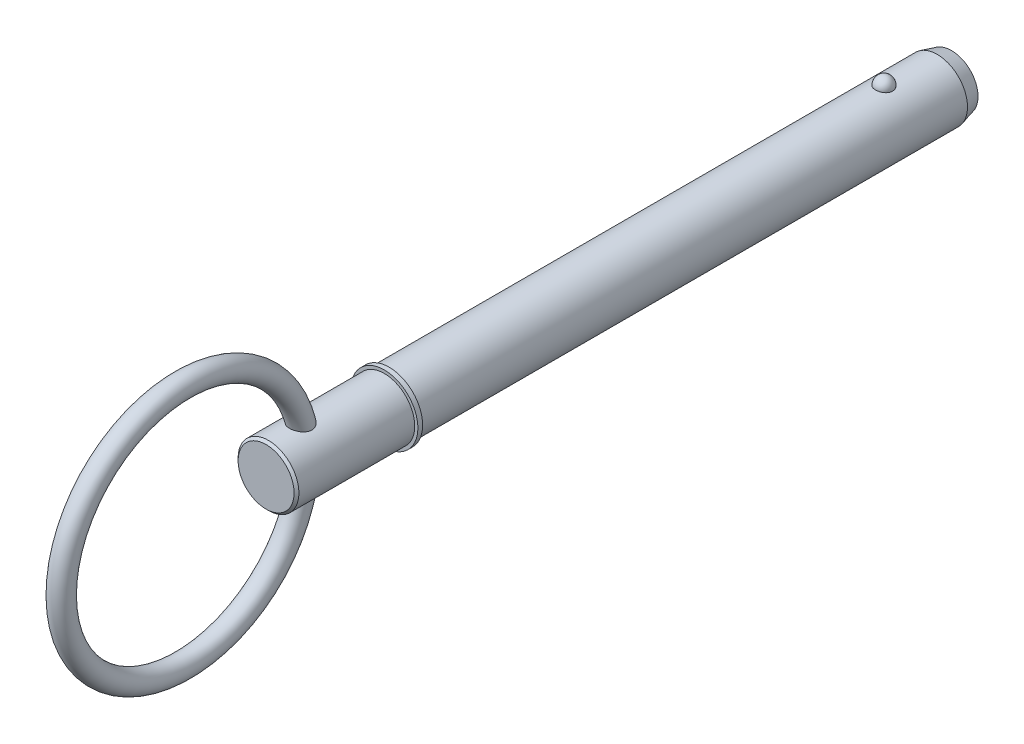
ISO-10303-21;
HEADER;
FILE_DESCRIPTION(('STEP AP214'),'2;1');
FILE_NAME('part.step','',(''),(''),'','','');
FILE_SCHEMA(('AUTOMOTIVE_DESIGN { 1 0 10303 214 1 1 1 1 }'));
ENDSEC;
DATA;
#1=APPLICATION_CONTEXT('core data for automotive mechanical design processes');
#2=APPLICATION_PROTOCOL_DEFINITION('international standard','automotive_design',2000,#1);
#3=PRODUCT_CONTEXT('',#1,'mechanical');
#4=PRODUCT('Part','Part','',(#3));
#5=PRODUCT_RELATED_PRODUCT_CATEGORY('part','',(#4));
#6=PRODUCT_DEFINITION_FORMATION('','',#4);
#7=PRODUCT_DEFINITION_CONTEXT('part definition',#1,'design');
#8=PRODUCT_DEFINITION('design','',#6,#7);
#9=PRODUCT_DEFINITION_SHAPE('','',#8);
#10=(LENGTH_UNIT() NAMED_UNIT(*) SI_UNIT(.MILLI.,.METRE.));
#11=(NAMED_UNIT(*) PLANE_ANGLE_UNIT() SI_UNIT($,.RADIAN.));
#12=(NAMED_UNIT(*) SI_UNIT($,.STERADIAN.) SOLID_ANGLE_UNIT());
#13=UNCERTAINTY_MEASURE_WITH_UNIT(LENGTH_MEASURE(1.E-05),#10,'distance_accuracy_value','');
#14=(GEOMETRIC_REPRESENTATION_CONTEXT(3) GLOBAL_UNCERTAINTY_ASSIGNED_CONTEXT((#13)) GLOBAL_UNIT_ASSIGNED_CONTEXT((#10,
#11,#12)) REPRESENTATION_CONTEXT('',''));
#15=CARTESIAN_POINT('',(0.,0.,0.));
#16=DIRECTION('',(0.,0.,1.));
#17=DIRECTION('',(1.,0.,0.));
#18=AXIS2_PLACEMENT_3D('',#15,#16,#17);
#19=CARTESIAN_POINT('',(0.,0.,101.6));
#20=DIRECTION('',(0.,0.,-1.));
#21=DIRECTION('',(-1.,0.,0.));
#22=AXIS2_PLACEMENT_3D('',#19,#20,#21);
#23=CYLINDRICAL_SURFACE('',#22,6.35);
#24=CARTESIAN_POINT('',(1.76243001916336,6.10051968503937,-1.78));
#25=CARTESIAN_POINT('',(1.76242835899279,6.10052111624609,-1.68050311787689));
#26=CARTESIAN_POINT('',(1.75431593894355,6.1028816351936,-1.58098521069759));
#27=CARTESIAN_POINT('',(1.72206027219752,6.11206037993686,-1.38476972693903));
#28=CARTESIAN_POINT('',(1.69791106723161,6.11888026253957,-1.28807321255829));
#29=CARTESIAN_POINT('',(1.63419596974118,6.13620287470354,-1.10029899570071));
#30=CARTESIAN_POINT('',(1.59463684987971,6.14670398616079,-1.00921884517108));
#31=CARTESIAN_POINT('',(1.50108569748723,6.17021534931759,-0.83516140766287));
#32=CARTESIAN_POINT('',(1.44709398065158,6.18322554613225,-0.752183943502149));
#33=CARTESIAN_POINT('',(1.3257243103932,6.21038081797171,-0.596209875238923));
#34=CARTESIAN_POINT('',(1.2582815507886,6.22453118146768,-0.523264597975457));
#35=CARTESIAN_POINT('',(1.11191624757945,6.25233390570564,-0.389855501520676));
#36=CARTESIAN_POINT('',(1.03299369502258,6.26598626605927,-0.329391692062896));
#37=CARTESIAN_POINT('',(0.866022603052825,6.29123226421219,-0.222793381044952));
#38=CARTESIAN_POINT('',(0.778000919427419,6.30283170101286,-0.176618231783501));
#39=CARTESIAN_POINT('',(0.59510847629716,6.32272058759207,-0.0996905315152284));
#40=CARTESIAN_POINT('',(0.500238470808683,6.33101040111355,-0.0689362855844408));
#41=CARTESIAN_POINT('',(0.308164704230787,6.34323464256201,-0.024159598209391));
#42=CARTESIAN_POINT('',(0.211033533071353,6.34724467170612,-0.00984637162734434));
#43=CARTESIAN_POINT('',(0.0156629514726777,6.3507318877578,0.00262058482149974));
#44=CARTESIAN_POINT('',(-0.0825763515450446,6.35020951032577,0.000775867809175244));
#45=CARTESIAN_POINT('',(-0.275890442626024,6.34473055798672,-0.0188727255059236));
#46=CARTESIAN_POINT('',(-0.370990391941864,6.3398374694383,-0.0364481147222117));
#47=CARTESIAN_POINT('',(-0.556805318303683,6.32622723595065,-0.0867447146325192));
#48=CARTESIAN_POINT('',(-0.647520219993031,6.31751002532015,-0.119466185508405));
#49=CARTESIAN_POINT('',(-0.822606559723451,6.29711353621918,-0.199386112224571));
#50=CARTESIAN_POINT('',(-0.906938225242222,6.28541739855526,-0.246667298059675));
#51=CARTESIAN_POINT('',(-1.06646479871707,6.26032612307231,-0.354365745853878));
#52=CARTESIAN_POINT('',(-1.14165877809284,6.24693081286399,-0.41478434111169));
#53=CARTESIAN_POINT('',(-1.2823514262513,6.21959142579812,-0.548435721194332));
#54=CARTESIAN_POINT('',(-1.34763761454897,6.2056417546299,-0.621891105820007));
#55=CARTESIAN_POINT('',(-1.4651153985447,6.17896241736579,-0.778815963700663));
#56=CARTESIAN_POINT('',(-1.51730606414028,6.16623283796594,-0.862286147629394));
#57=CARTESIAN_POINT('',(-1.60782211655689,6.14325839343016,-1.03799158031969));
#58=CARTESIAN_POINT('',(-1.64598111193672,6.13304379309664,-1.13031660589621));
#59=CARTESIAN_POINT('',(-1.70661885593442,6.11644899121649,-1.32030667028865));
#60=CARTESIAN_POINT('',(-1.72909805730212,6.11006867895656,-1.41797155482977));
#61=CARTESIAN_POINT('',(-1.75775019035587,6.1018881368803,-1.61543246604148));
#62=CARTESIAN_POINT('',(-1.76399136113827,6.10006874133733,-1.71521779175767));
#63=CARTESIAN_POINT('',(-1.76020715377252,6.10116172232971,-1.91445126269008));
#64=CARTESIAN_POINT('',(-1.75018221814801,6.10407397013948,-2.01389941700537));
#65=CARTESIAN_POINT('',(-1.71421005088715,6.11427232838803,-2.20912106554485));
#66=CARTESIAN_POINT('',(-1.68834262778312,6.12153651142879,-2.30491043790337));
#67=CARTESIAN_POINT('',(-1.62139543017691,6.1396067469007,-2.49066180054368));
#68=CARTESIAN_POINT('',(-1.5803150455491,6.15041294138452,-2.58062355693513));
#69=CARTESIAN_POINT('',(-1.48369112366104,6.17443456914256,-2.75271428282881));
#70=CARTESIAN_POINT('',(-1.42806998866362,6.18766281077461,-2.83479789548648));
#71=CARTESIAN_POINT('',(-1.30386620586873,6.21501934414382,-2.98832532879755));
#72=CARTESIAN_POINT('',(-1.23528306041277,6.22914767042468,-3.05976874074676));
#73=CARTESIAN_POINT('',(-1.08663999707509,6.25679135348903,-3.19029656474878));
#74=CARTESIAN_POINT('',(-1.00653826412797,6.27030422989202,-3.24933392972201));
#75=CARTESIAN_POINT('',(-0.837212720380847,6.29514770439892,-3.35304657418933));
#76=CARTESIAN_POINT('',(-0.747989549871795,6.30647845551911,-3.39772286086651));
#77=CARTESIAN_POINT('',(-0.564098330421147,6.32556124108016,-3.47096393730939));
#78=CARTESIAN_POINT('',(-0.469512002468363,6.33335611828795,-3.49972259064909));
#79=CARTESIAN_POINT('',(-0.27663389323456,6.34470628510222,-3.54113722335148));
#80=CARTESIAN_POINT('',(-0.17834256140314,6.34826208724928,-3.55379514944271));
#81=CARTESIAN_POINT('',(0.0171660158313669,6.35071525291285,-3.56255473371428));
#82=CARTESIAN_POINT('',(0.114368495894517,6.34969931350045,-3.55896450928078));
#83=CARTESIAN_POINT('',(0.306746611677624,6.34331695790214,-3.53603383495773));
#84=CARTESIAN_POINT('',(0.401922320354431,6.33795069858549,-3.51669395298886));
#85=CARTESIAN_POINT('',(0.587203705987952,6.32347219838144,-3.4629173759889));
#86=CARTESIAN_POINT('',(0.677327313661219,6.31437430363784,-3.42853846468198));
#87=CARTESIAN_POINT('',(0.850462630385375,6.29339543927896,-3.34564128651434));
#88=CARTESIAN_POINT('',(0.933473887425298,6.2815142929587,-3.29712212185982));
#89=CARTESIAN_POINT('',(1.09144542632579,6.25601750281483,-3.18638742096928));
#90=CARTESIAN_POINT('',(1.16626195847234,6.24237795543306,-3.12397237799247));
#91=CARTESIAN_POINT('',(1.304448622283,6.21497285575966,-2.98755865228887));
#92=CARTESIAN_POINT('',(1.36781676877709,6.20120728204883,-2.91355796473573));
#93=CARTESIAN_POINT('',(1.48252779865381,6.17479923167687,-2.75456133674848));
#94=CARTESIAN_POINT('',(1.53364167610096,6.16218052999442,-2.66939613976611));
#95=CARTESIAN_POINT('',(1.62109397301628,6.13975602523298,-2.49147502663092));
#96=CARTESIAN_POINT('',(1.657437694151,6.12994921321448,-2.39872184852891));
#97=CARTESIAN_POINT('',(1.71127844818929,6.11512175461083,-2.21887622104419));
#98=CARTESIAN_POINT('',(1.73042646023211,6.10968903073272,-2.13230770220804));
#99=CARTESIAN_POINT('',(1.75600284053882,6.10238739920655,-1.95716498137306));
#100=CARTESIAN_POINT('',(1.76243149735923,6.10051841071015,-1.86859082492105));
#101=CARTESIAN_POINT('',(1.76243001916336,6.10051968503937,-1.78));
#102=B_SPLINE_CURVE_WITH_KNOTS('',3,(#24,#25,#26,#27,#28,#29,#30,#31,#32,#33,#34,#35,#36,#37,
#38,#39,#40,#41,#42,#43,#44,#45,#46,#47,#48,#49,#50,#51,#52,#53,#54,#55,#56,#57,#58,#59,#60,#61,
#62,#63,#64,#65,#66,#67,#68,#69,#70,#71,#72,#73,#74,#75,#76,#77,#78,#79,#80,#81,#82,#83,#84,#85,
#86,#87,#88,#89,#90,#91,#92,#93,#94,#95,#96,#97,#98,#99,#100,#101),.UNSPECIFIED.,.T.,.F.,(4,2,2,
2,2,2,2,2,2,2,2,2,2,2,2,2,2,2,2,2,2,2,2,2,2,2,2,2,2,2,2,2,2,2,2,2,2,2,4),(0.,0.298172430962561,
0.596455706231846,0.894608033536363,1.19275383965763,1.49237238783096,1.79199116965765,
2.09074960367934,2.38947519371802,2.68283180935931,2.97616022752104,3.26529599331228,
3.5544367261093,3.84525169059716,4.13609618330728,4.43249276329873,4.72891038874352,
5.02873757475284,5.32855610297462,5.62711261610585,5.92566100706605,6.22271765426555,
6.519786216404,6.81847366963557,7.11717259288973,7.41698459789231,7.71677557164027,
8.01283014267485,8.30884891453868,8.59927798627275,8.88969658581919,9.17900899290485,
9.46833977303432,9.76212836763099,10.0559678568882,10.3549321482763,10.6537890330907,
10.9192841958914,11.1847733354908),.UNSPECIFIED.);
#103=CARTESIAN_POINT('',(1.76243001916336,6.10051968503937,-1.78));
#104=VERTEX_POINT('',#103);
#105=EDGE_CURVE('E100',#104,#104,#102,.T.);
#106=ORIENTED_EDGE('',*,*,#105,.T.);
#107=EDGE_LOOP('',(#106));
#108=FACE_BOUND('',#107,.T.);
#109=CARTESIAN_POINT('',(0.,0.,-12.88));
#110=DIRECTION('',(0.,0.,-1.));
#111=DIRECTION('',(-1.,0.,0.));
#112=AXIS2_PLACEMENT_3D('',#109,#110,#111);
#113=CIRCLE('',#112,6.35);
#114=CARTESIAN_POINT('',(-6.35,0.,-12.88));
#115=VERTEX_POINT('',#114);
#116=EDGE_CURVE('E108',#115,#115,#113,.F.);
#117=ORIENTED_EDGE('',*,*,#116,.T.);
#118=EDGE_LOOP('',(#117));
#119=FACE_BOUND('',#118,.T.);
#120=CARTESIAN_POINT('',(0.,0.,101.6));
#121=DIRECTION('',(0.,0.,1.));
#122=DIRECTION('',(1.,0.,0.));
#123=AXIS2_PLACEMENT_3D('',#120,#121,#122);
#124=CIRCLE('',#123,6.35);
#125=CARTESIAN_POINT('',(6.35,0.,101.6));
#126=VERTEX_POINT('',#125);
#127=EDGE_CURVE('E106',#126,#126,#124,.T.);
#128=ORIENTED_EDGE('',*,*,#127,.F.);
#129=EDGE_LOOP('',(#128));
#130=FACE_BOUND('',#129,.T.);
#131=ADVANCED_FACE('F39',(#108,#119,#130),#23,.T.);
#132=CARTESIAN_POINT('',(0.,0.,-15.88));
#133=DIRECTION('',(0.,0.,-1.));
#134=DIRECTION('',(-1.,0.,0.));
#135=AXIS2_PLACEMENT_3D('',#132,#133,#134);
#136=PLANE('',#135);
#137=CARTESIAN_POINT('',(0.,0.,-15.88));
#138=DIRECTION('',(0.,0.,-1.));
#139=DIRECTION('',(-1.,0.,0.));
#140=AXIS2_PLACEMENT_3D('',#137,#138,#139);
#141=CIRCLE('',#140,5.54615242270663);
#142=CARTESIAN_POINT('',(-5.54615242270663,0.,-15.88));
#143=VERTEX_POINT('',#142);
#144=EDGE_CURVE('E141',#143,#143,#141,.T.);
#145=ORIENTED_EDGE('',*,*,#144,.T.);
#146=EDGE_LOOP('',(#145));
#147=FACE_BOUND('',#146,.T.);
#148=ADVANCED_FACE('F86',(#147),#136,.T.);
#149=CARTESIAN_POINT('',(0.,0.,-15.88));
#150=DIRECTION('',(0.,0.,1.));
#151=DIRECTION('',(1.,0.,0.));
#152=AXIS2_PLACEMENT_3D('',#149,#150,#151);
#153=CONICAL_SURFACE('',#152,5.54615242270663,0.261799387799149);
#154=ORIENTED_EDGE('',*,*,#116,.F.);
#155=EDGE_LOOP('',(#154));
#156=FACE_BOUND('',#155,.T.);
#157=ORIENTED_EDGE('',*,*,#144,.F.);
#158=EDGE_LOOP('',(#157));
#159=FACE_BOUND('',#158,.T.);
#160=ADVANCED_FACE('F92',(#156,#159),#153,.T.);
#161=CARTESIAN_POINT('',(0.,6.35,-1.78));
#162=DIRECTION('',(0.,1.,0.));
#163=DIRECTION('',(0.,0.,1.));
#164=AXIS2_PLACEMENT_3D('',#161,#162,#163);
#165=SPHERICAL_SURFACE('',#164,1.78);
#166=ORIENTED_EDGE('',*,*,#105,.F.);
#167=EDGE_LOOP('',(#166));
#168=FACE_BOUND('',#167,.T.);
#169=ADVANCED_FACE('F111',(#168),#165,.T.);
#170=CARTESIAN_POINT('',(0.,0.,101.6));
#171=DIRECTION('',(0.,0.,-1.));
#172=DIRECTION('',(-1.,0.,0.));
#173=AXIS2_PLACEMENT_3D('',#170,#171,#172);
#174=PLANE('',#173);
#175=ORIENTED_EDGE('',*,*,#127,.T.);
#176=EDGE_LOOP('',(#175));
#177=FACE_BOUND('',#176,.T.);
#178=CARTESIAN_POINT('',(0.,0.,101.6));
#179=DIRECTION('',(0.,0.,-1.));
#180=DIRECTION('',(-1.,0.,0.));
#181=AXIS2_PLACEMENT_3D('',#178,#179,#180);
#182=CIRCLE('',#181,7.);
#183=CARTESIAN_POINT('',(-7.,0.,101.6));
#184=VERTEX_POINT('',#183);
#185=EDGE_CURVE('E107',#184,#184,#182,.T.);
#186=ORIENTED_EDGE('',*,*,#185,.T.);
#187=EDGE_LOOP('',(#186));
#188=FACE_BOUND('',#187,.T.);
#189=ADVANCED_FACE('F115',(#177,#188),#174,.T.);
#190=CARTESIAN_POINT('',(0.,0.,33.7287874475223));
#191=DIRECTION('',(0.,0.,-1.));
#192=DIRECTION('',(-1.,0.,0.));
#193=AXIS2_PLACEMENT_3D('',#190,#191,#192);
#194=CYLINDRICAL_SURFACE('',#193,7.);
#195=CARTESIAN_POINT('',(0.,0.,102.6));
#196=DIRECTION('',(0.,0.,-1.));
#197=DIRECTION('',(-1.,0.,0.));
#198=AXIS2_PLACEMENT_3D('',#195,#196,#197);
#199=CIRCLE('',#198,7.);
#200=CARTESIAN_POINT('',(-7.,0.,102.6));
#201=VERTEX_POINT('',#200);
#202=EDGE_CURVE('E132',#201,#201,#199,.T.);
#203=ORIENTED_EDGE('',*,*,#202,.T.);
#204=EDGE_LOOP('',(#203));
#205=FACE_BOUND('',#204,.T.);
#206=ORIENTED_EDGE('',*,*,#185,.F.);
#207=EDGE_LOOP('',(#206));
#208=FACE_BOUND('',#207,.T.);
#209=ADVANCED_FACE('F119',(#205,#208),#194,.T.);
#210=CARTESIAN_POINT('',(0.,7.,102.6));
#211=DIRECTION('',(0.,0.,1.));
#212=DIRECTION('',(1.,0.,0.));
#213=AXIS2_PLACEMENT_3D('',#210,#211,#212);
#214=PLANE('',#213);
#215=CARTESIAN_POINT('',(0.,0.,102.6));
#216=DIRECTION('',(0.,0.,1.));
#217=DIRECTION('',(1.,0.,0.));
#218=AXIS2_PLACEMENT_3D('',#215,#216,#217);
#219=CIRCLE('',#218,6.35);
#220=CARTESIAN_POINT('',(6.35,0.,102.6));
#221=VERTEX_POINT('',#220);
#222=EDGE_CURVE('E110',#221,#221,#219,.T.);
#223=ORIENTED_EDGE('',*,*,#222,.F.);
#224=EDGE_LOOP('',(#223));
#225=FACE_BOUND('',#224,.T.);
#226=ORIENTED_EDGE('',*,*,#202,.F.);
#227=EDGE_LOOP('',(#226));
#228=FACE_BOUND('',#227,.T.);
#229=ADVANCED_FACE('F83',(#225,#228),#214,.T.);
#230=CARTESIAN_POINT('',(0.,0.,127.3));
#231=DIRECTION('',(0.,0.,-1.));
#232=DIRECTION('',(-1.,0.,0.));
#233=AXIS2_PLACEMENT_3D('',#230,#231,#232);
#234=CYLINDRICAL_SURFACE('',#233,6.35);
#235=CARTESIAN_POINT('',(-1.08120660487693,-6.25727514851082,118.05158117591));
#236=CARTESIAN_POINT('',(-0.970724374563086,-6.27636409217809,117.993879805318));
#237=CARTESIAN_POINT('',(-0.855136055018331,-6.29329984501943,117.945219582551));
#238=CARTESIAN_POINT('',(-0.616958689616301,-6.32109419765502,117.86705594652));
#239=CARTESIAN_POINT('',(-0.494369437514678,-6.3319526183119,117.83755309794));
#240=CARTESIAN_POINT('',(-0.245606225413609,-6.34647141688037,117.798367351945));
#241=CARTESIAN_POINT('',(-0.119431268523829,-6.35012977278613,117.788690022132));
#242=CARTESIAN_POINT('',(0.132849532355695,-6.34986313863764,117.789400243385));
#243=CARTESIAN_POINT('',(0.258955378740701,-6.34593843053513,117.799787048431));
#244=CARTESIAN_POINT('',(0.50691297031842,-6.33094785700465,117.840285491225));
#245=CARTESIAN_POINT('',(0.628781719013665,-6.31991516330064,117.870305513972));
#246=CARTESIAN_POINT('',(0.865486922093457,-6.29187143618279,117.949308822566));
#247=CARTESIAN_POINT('',(0.980322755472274,-6.27485987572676,117.998293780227));
#248=CARTESIAN_POINT('',(1.20050616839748,-6.23649440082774,118.114540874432));
#249=CARTESIAN_POINT('',(1.30578867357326,-6.21511352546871,118.181917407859));
#250=CARTESIAN_POINT('',(1.50311440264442,-6.17036440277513,118.333359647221));
#251=CARTESIAN_POINT('',(1.59515714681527,-6.14699608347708,118.417425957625));
#252=CARTESIAN_POINT('',(1.76326863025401,-6.10090072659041,118.600247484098));
#253=CARTESIAN_POINT('',(1.83935482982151,-6.07817301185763,118.698986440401));
#254=CARTESIAN_POINT('',(1.97338559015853,-6.03599268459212,118.908703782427));
#255=CARTESIAN_POINT('',(2.03133638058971,-6.01653894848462,119.019677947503));
#256=CARTESIAN_POINT('',(2.1259120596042,-5.98376466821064,119.247018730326));
#257=CARTESIAN_POINT('',(2.16315310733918,-5.97026970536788,119.363104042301));
#258=CARTESIAN_POINT('',(2.21830650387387,-5.94999923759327,119.600318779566));
#259=CARTESIAN_POINT('',(2.2362211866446,-5.94322292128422,119.721447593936));
#260=CARTESIAN_POINT('',(2.25273772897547,-5.93698111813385,119.963281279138));
#261=CARTESIAN_POINT('',(2.25163224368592,-5.93740484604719,120.083964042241));
#262=CARTESIAN_POINT('',(2.23167546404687,-5.94493297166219,120.323620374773));
#263=CARTESIAN_POINT('',(2.21281883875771,-5.9520393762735,120.442593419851));
#264=CARTESIAN_POINT('',(2.15679576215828,-5.97257680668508,120.683836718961));
#265=CARTESIAN_POINT('',(2.11851138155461,-5.98639144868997,120.80581287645));
#266=CARTESIAN_POINT('',(2.02470263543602,-6.01876484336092,121.042284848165));
#267=CARTESIAN_POINT('',(1.96916879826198,-6.03732620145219,121.156776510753));
#268=CARTESIAN_POINT('',(1.8352662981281,-6.07945247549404,121.387995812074));
#269=CARTESIAN_POINT('',(1.75507038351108,-6.10334207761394,121.503611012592));
#270=CARTESIAN_POINT('',(1.57657889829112,-6.15186551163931,121.719894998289));
#271=CARTESIAN_POINT('',(1.47827192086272,-6.17649980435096,121.820554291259));
#272=CARTESIAN_POINT('',(1.26306696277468,-6.22410762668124,122.005023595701));
#273=CARTESIAN_POINT('',(1.14585214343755,-6.24704086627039,122.088478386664));
#274=CARTESIAN_POINT('',(0.896825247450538,-6.28760987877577,122.231400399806));
#275=CARTESIAN_POINT('',(0.765036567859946,-6.30525397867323,122.290905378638));
#276=CARTESIAN_POINT('',(0.509454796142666,-6.330648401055,122.375263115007));
#277=CARTESIAN_POINT('',(0.386964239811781,-6.33940909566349,122.403695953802));
#278=CARTESIAN_POINT('',(0.200813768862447,-6.3471308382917,122.428680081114));
#279=CARTESIAN_POINT('',(0.138353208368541,-6.34880140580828,122.434063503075));
#280=CARTESIAN_POINT('',(0.013184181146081,-6.35029448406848,122.43887386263));
#281=CARTESIAN_POINT('',(-0.04952425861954,-6.35011719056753,122.438301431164));
#282=CARTESIAN_POINT('',(-0.219860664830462,-6.34710452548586,122.428597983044));
#283=CARTESIAN_POINT('',(-0.327176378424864,-6.34243953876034,122.413576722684));
#284=CARTESIAN_POINT('',(-0.537619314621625,-6.32808248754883,122.366673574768));
#285=CARTESIAN_POINT('',(-0.640746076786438,-6.31838987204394,122.334789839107));
#286=CARTESIAN_POINT('',(-0.841795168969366,-6.29478075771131,122.255337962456));
#287=CARTESIAN_POINT('',(-0.939631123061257,-6.28081033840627,122.20756888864));
#288=CARTESIAN_POINT('',(-1.12690564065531,-6.2499288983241,122.098513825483));
#289=CARTESIAN_POINT('',(-1.21634109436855,-6.2330167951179,122.037222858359));
#290=CARTESIAN_POINT('',(-1.3971303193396,-6.19517308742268,121.894039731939));
#291=CARTESIAN_POINT('',(-1.48711596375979,-6.17400700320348,121.810483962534));
#292=CARTESIAN_POINT('',(-1.65373642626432,-6.13148145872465,121.630996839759));
#293=CARTESIAN_POINT('',(-1.73036130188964,-6.11012186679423,121.53505636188));
#294=CARTESIAN_POINT('',(-1.87908981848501,-6.06616529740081,121.318620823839));
#295=CARTESIAN_POINT('',(-1.94902044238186,-6.04382072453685,121.196572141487));
#296=CARTESIAN_POINT('',(-2.06849605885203,-6.00398244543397,120.942070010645));
#297=CARTESIAN_POINT('',(-2.11803457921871,-5.98649027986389,120.809613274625));
#298=CARTESIAN_POINT('',(-2.19551930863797,-5.95851933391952,120.534593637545));
#299=CARTESIAN_POINT('',(-2.22297667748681,-5.94819998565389,120.391874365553));
#300=CARTESIAN_POINT('',(-2.25222139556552,-5.93719450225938,120.103480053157));
#301=CARTESIAN_POINT('',(-2.25403508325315,-5.93649848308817,119.957808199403));
#302=CARTESIAN_POINT('',(-2.23178480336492,-5.94489150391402,119.683804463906));
#303=CARTESIAN_POINT('',(-2.21035650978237,-5.95298402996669,119.555226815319));
#304=CARTESIAN_POINT('',(-2.14565882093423,-5.97660650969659,119.30440891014));
#305=CARTESIAN_POINT('',(-2.10239634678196,-5.99213410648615,119.182166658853));
#306=CARTESIAN_POINT('',(-1.99913159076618,-6.02732890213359,118.956747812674));
#307=CARTESIAN_POINT('',(-1.94060271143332,-6.04660536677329,118.852829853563));
#308=CARTESIAN_POINT('',(-1.80736340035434,-6.0877569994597,118.656534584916));
#309=CARTESIAN_POINT('',(-1.73265259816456,-6.10963222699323,118.564157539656));
#310=CARTESIAN_POINT('',(-1.56865095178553,-6.15378470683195,118.392603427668));
#311=CARTESIAN_POINT('',(-1.47928749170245,-6.17606344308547,118.313496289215));
#312=CARTESIAN_POINT('',(-1.28858731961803,-6.21864788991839,118.170675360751));
#313=CARTESIAN_POINT('',(-1.18724893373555,-6.23895332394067,118.106963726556));
#314=CARTESIAN_POINT('',(-1.08120660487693,-6.25727514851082,118.05158117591));
#315=B_SPLINE_CURVE_WITH_KNOTS('',3,(#235,#236,#237,#238,#239,#240,#241,#242,#243,#244,#245,
#246,#247,#248,#249,#250,#251,#252,#253,#254,#255,#256,#257,#258,#259,#260,#261,#262,#263,#264,
#265,#266,#267,#268,#269,#270,#271,#272,#273,#274,#275,#276,#277,#278,#279,#280,#281,#282,#283,
#284,#285,#286,#287,#288,#289,#290,#291,#292,#293,#294,#295,#296,#297,#298,#299,#300,#301,#302,
#303,#304,#305,#306,#307,#308,#309,#310,#311,#312,#313,#314),.UNSPECIFIED.,.T.,.F.,(4,2,2,2,2,2,
2,2,2,2,2,2,2,2,2,2,2,2,2,2,2,2,2,2,2,2,2,2,2,2,2,2,2,2,2,2,2,2,2,4),(0.,0.377861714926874,
0.755734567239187,1.13371352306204,1.51167842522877,1.88789208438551,2.26413891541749,
2.64278156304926,3.02143792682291,3.39967776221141,3.77778752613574,4.14394628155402,
4.51006081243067,4.87054720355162,5.23114188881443,5.61534494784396,5.99975934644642,
6.42600522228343,6.85252048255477,7.28711365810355,7.72101899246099,8.0966613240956,
8.28452949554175,8.47237776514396,8.79607953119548,9.11981678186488,9.44781545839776,
9.77593508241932,10.1483085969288,10.5209580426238,10.9463240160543,11.3718248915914,
11.8065046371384,12.2407378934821,12.6304236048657,13.0199858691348,13.3807583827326,
13.7415391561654,14.104165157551,14.4668419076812),.UNSPECIFIED.);
#316=CARTESIAN_POINT('',(-1.08120660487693,-6.25727514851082,118.05158117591));
#317=VERTEX_POINT('',#316);
#318=EDGE_CURVE('E10',#317,#317,#315,.T.);
#319=ORIENTED_EDGE('',*,*,#318,.F.);
#320=EDGE_LOOP('',(#319));
#321=FACE_BOUND('',#320,.T.);
#322=CARTESIAN_POINT('',(-1.08120660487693,6.25727514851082,118.05158117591));
#323=CARTESIAN_POINT('',(-1.19093168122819,6.23831652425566,118.108887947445));
#324=CARTESIAN_POINT('',(-1.29562751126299,6.21723224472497,118.175116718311));
#325=CARTESIAN_POINT('',(-1.49211272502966,6.17302620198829,118.324020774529));
#326=CARTESIAN_POINT('',(-1.58390200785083,6.14990442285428,118.406696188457));
#327=CARTESIAN_POINT('',(-1.75209695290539,6.10411985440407,118.586777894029));
#328=CARTESIAN_POINT('',(-1.82848346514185,6.08145766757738,118.684202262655));
#329=CARTESIAN_POINT('',(-1.96346259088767,6.0392331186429,118.891273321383));
#330=CARTESIAN_POINT('',(-2.02206050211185,6.01966983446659,119.000916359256));
#331=CARTESIAN_POINT('',(-2.11860444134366,5.9863659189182,119.226564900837));
#332=CARTESIAN_POINT('',(-2.15701637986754,5.97249571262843,119.342351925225));
#333=CARTESIAN_POINT('',(-2.21449304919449,5.95142584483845,119.579191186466));
#334=CARTESIAN_POINT('',(-2.23356015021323,5.94422536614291,119.700242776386));
#335=CARTESIAN_POINT('',(-2.25228141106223,5.93715610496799,119.941944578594));
#336=CARTESIAN_POINT('',(-2.25225786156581,5.93716560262,120.062567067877));
#337=CARTESIAN_POINT('',(-2.2344206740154,5.94389982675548,120.302277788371));
#338=CARTESIAN_POINT('',(-2.21660184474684,5.95062651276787,120.421365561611));
#339=CARTESIAN_POINT('',(-2.16272689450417,5.97042554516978,120.662705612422));
#340=CARTESIAN_POINT('',(-2.12559286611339,5.98387086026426,120.784684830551));
#341=CARTESIAN_POINT('',(-2.03409944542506,6.0155857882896,121.021342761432));
#342=CARTESIAN_POINT('',(-1.97973080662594,6.03385799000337,121.136017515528));
#343=CARTESIAN_POINT('',(-1.84828023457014,6.07549301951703,121.367865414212));
#344=CARTESIAN_POINT('',(-1.76936622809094,6.09919386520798,121.483943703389));
#345=CARTESIAN_POINT('',(-1.59344783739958,6.14749881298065,121.701420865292));
#346=CARTESIAN_POINT('',(-1.49643151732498,6.17210350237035,121.802809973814));
#347=CARTESIAN_POINT('',(-1.28333318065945,6.21994692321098,121.989508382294));
#348=CARTESIAN_POINT('',(-1.16685721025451,6.24314005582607,122.0743845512));
#349=CARTESIAN_POINT('',(-0.919062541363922,6.2843871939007,122.22034404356));
#350=CARTESIAN_POINT('',(-0.787766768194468,6.30244898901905,122.281463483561));
#351=CARTESIAN_POINT('',(-0.532335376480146,6.32876911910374,122.36911129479));
#352=CARTESIAN_POINT('',(-0.409516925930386,6.33800211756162,122.399123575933));
#353=CARTESIAN_POINT('',(-0.222636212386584,6.34640533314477,122.426338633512));
#354=CARTESIAN_POINT('',(-0.159893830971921,6.34829860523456,122.432442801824));
#355=CARTESIAN_POINT('',(-0.0340877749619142,6.35021985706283,122.43863417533));
#356=CARTESIAN_POINT('',(0.0289758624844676,6.35024804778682,122.43872206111));
#357=CARTESIAN_POINT('',(0.200008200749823,6.34776620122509,122.430732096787));
#358=CARTESIAN_POINT('',(0.307730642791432,6.34342046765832,122.41675007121));
#359=CARTESIAN_POINT('',(0.51913450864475,6.32963338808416,122.371765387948));
#360=CARTESIAN_POINT('',(0.622815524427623,6.3201915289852,122.340761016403));
#361=CARTESIAN_POINT('',(0.824580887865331,6.2970603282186,122.263086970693));
#362=CARTESIAN_POINT('',(0.922611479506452,6.28333629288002,122.216289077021));
#363=CARTESIAN_POINT('',(1.11039970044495,6.2528858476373,122.109122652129));
#364=CARTESIAN_POINT('',(1.20015435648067,6.23615836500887,122.048749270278));
#365=CARTESIAN_POINT('',(1.38155818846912,6.19866747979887,121.90760245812));
#366=CARTESIAN_POINT('',(1.47187645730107,6.17766310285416,121.825184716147));
#367=CARTESIAN_POINT('',(1.6393362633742,6.135352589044,121.647946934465));
#368=CARTESIAN_POINT('',(1.71646809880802,6.11404624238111,121.553117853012));
#369=CARTESIAN_POINT('',(1.86660460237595,6.07002946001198,121.338851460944));
#370=CARTESIAN_POINT('',(1.93743710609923,6.04755477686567,121.217834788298));
#371=CARTESIAN_POINT('',(2.0589430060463,6.00727604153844,120.965280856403));
#372=CARTESIAN_POINT('',(2.1096091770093,5.98947366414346,120.833739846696));
#373=CARTESIAN_POINT('',(2.18982014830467,5.96062717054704,120.559758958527));
#374=CARTESIAN_POINT('',(2.21877575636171,5.94977267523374,120.417123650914));
#375=CARTESIAN_POINT('',(2.2510475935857,5.93764416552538,120.128595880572));
#376=CARTESIAN_POINT('',(2.25438985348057,5.93636042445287,119.982706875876));
#377=CARTESIAN_POINT('',(2.23498011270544,5.9436885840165,119.707731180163));
#378=CARTESIAN_POINT('',(2.21482640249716,5.95131530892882,119.578434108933));
#379=CARTESIAN_POINT('',(2.15248760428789,5.97414352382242,119.325969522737));
#380=CARTESIAN_POINT('',(2.11031020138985,5.98934237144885,119.202799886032));
#381=CARTESIAN_POINT('',(2.00904610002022,6.02402214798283,118.975783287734));
#382=CARTESIAN_POINT('',(1.95150192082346,6.04308594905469,118.871178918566));
#383=CARTESIAN_POINT('',(1.82009972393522,6.08395083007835,118.673382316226));
#384=CARTESIAN_POINT('',(1.74624088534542,6.10575204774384,118.580190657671));
#385=CARTESIAN_POINT('',(1.58309476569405,6.15008431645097,118.406164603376));
#386=CARTESIAN_POINT('',(1.49360904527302,6.17262128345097,118.325518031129));
#387=CARTESIAN_POINT('',(1.30231515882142,6.21579297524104,118.179836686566));
#388=CARTESIAN_POINT('',(1.20050521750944,6.23642742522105,118.11480416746));
#389=CARTESIAN_POINT('',(0.98378657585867,6.27432316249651,117.9998596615));
#390=CARTESIAN_POINT('',(0.868563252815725,6.29145558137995,117.950497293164));
#391=CARTESIAN_POINT('',(0.630994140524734,6.31970327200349,117.870885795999));
#392=CARTESIAN_POINT('',(0.508648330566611,6.33081852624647,117.840636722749));
#393=CARTESIAN_POINT('',(0.259933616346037,6.34590352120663,117.799879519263));
#394=CARTESIAN_POINT('',(0.133554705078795,6.34985380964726,117.789425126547));
#395=CARTESIAN_POINT('',(-0.119270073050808,6.35013815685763,117.788667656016));
#396=CARTESIAN_POINT('',(-0.245715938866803,6.34647233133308,117.798364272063));
#397=CARTESIAN_POINT('',(-0.494670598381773,6.33192772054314,117.837620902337));
#398=CARTESIAN_POINT('',(-0.617189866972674,6.3210701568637,117.867122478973));
#399=CARTESIAN_POINT('',(-0.855240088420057,6.29328476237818,117.945263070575));
#400=CARTESIAN_POINT('',(-0.970770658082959,6.27635659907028,117.993903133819));
#401=CARTESIAN_POINT('',(-1.08120660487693,6.25727514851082,118.05158117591));
#402=B_SPLINE_CURVE_WITH_KNOTS('',3,(#322,#323,#324,#325,#326,#327,#328,#329,#330,#331,#332,
#333,#334,#335,#336,#337,#338,#339,#340,#341,#342,#343,#344,#345,#346,#347,#348,#349,#350,#351,
#352,#353,#354,#355,#356,#357,#358,#359,#360,#361,#362,#363,#364,#365,#366,#367,#368,#369,#370,
#371,#372,#373,#374,#375,#376,#377,#378,#379,#380,#381,#382,#383,#384,#385,#386,#387,#388,#389,
#390,#391,#392,#393,#394,#395,#396,#397,#398,#399,#400,#401),.UNSPECIFIED.,.T.,.F.,(4,2,2,2,2,2,
2,2,2,2,2,2,2,2,2,2,2,2,2,2,2,2,2,2,2,2,2,2,2,2,2,2,2,2,2,2,2,2,2,4),(0.,0.375258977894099,
0.750520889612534,1.1262465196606,1.50186014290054,1.86837438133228,2.2348437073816,
2.59512638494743,2.95551419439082,3.33859924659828,3.7218901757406,4.14704029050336,
4.57247172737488,5.00788576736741,5.4426352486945,5.82040093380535,6.00932292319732,
6.19822354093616,6.52266071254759,6.84713055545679,7.17430063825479,7.50158780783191,
7.87233275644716,8.24334931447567,8.66748794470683,9.09177840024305,9.52720369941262,
9.96218641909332,10.3532895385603,10.7442562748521,11.1052784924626,11.4663188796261,
11.8323306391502,12.1983951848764,12.5761580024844,12.9539219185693,13.3327099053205,
13.7114921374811,14.0891615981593,14.4668517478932),.UNSPECIFIED.);
#403=CARTESIAN_POINT('',(-1.08120660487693,6.25727514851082,118.05158117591));
#404=VERTEX_POINT('',#403);
#405=EDGE_CURVE('E51',#404,#404,#402,.T.);
#406=ORIENTED_EDGE('',*,*,#405,.F.);
#407=EDGE_LOOP('',(#406));
#408=FACE_BOUND('',#407,.T.);
#409=CARTESIAN_POINT('',(0.,0.,126.8));
#410=DIRECTION('',(0.,0.,-1.));
#411=DIRECTION('',(-1.,0.,0.));
#412=AXIS2_PLACEMENT_3D('',#409,#410,#411);
#413=CIRCLE('',#412,6.35);
#414=CARTESIAN_POINT('',(-6.35,0.,126.8));
#415=VERTEX_POINT('',#414);
#416=EDGE_CURVE('E62',#415,#415,#413,.T.);
#417=ORIENTED_EDGE('',*,*,#416,.T.);
#418=EDGE_LOOP('',(#417));
#419=FACE_BOUND('',#418,.T.);
#420=ORIENTED_EDGE('',*,*,#222,.T.);
#421=EDGE_LOOP('',(#420));
#422=FACE_BOUND('',#421,.T.);
#423=ADVANCED_FACE('F67',(#321,#408,#419,#422),#234,.T.);
#424=CARTESIAN_POINT('',(0.,0.,127.3));
#425=DIRECTION('',(0.,0.,-1.));
#426=DIRECTION('',(-1.,0.,0.));
#427=AXIS2_PLACEMENT_3D('',#424,#425,#426);
#428=PLANE('',#427);
#429=CARTESIAN_POINT('',(0.,0.,127.3));
#430=DIRECTION('',(0.,0.,-1.));
#431=DIRECTION('',(-1.,0.,0.));
#432=AXIS2_PLACEMENT_3D('',#429,#430,#431);
#433=CIRCLE('',#432,5.84999999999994);
#434=CARTESIAN_POINT('',(-5.84999999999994,0.,127.3));
#435=VERTEX_POINT('',#434);
#436=EDGE_CURVE('E57',#435,#435,#433,.F.);
#437=ORIENTED_EDGE('',*,*,#436,.T.);
#438=EDGE_LOOP('',(#437));
#439=FACE_BOUND('',#438,.T.);
#440=ADVANCED_FACE('F74',(#439),#428,.F.);
#441=CARTESIAN_POINT('',(0.,0.,126.8));
#442=DIRECTION('',(0.,0.,-1.));
#443=DIRECTION('',(-1.,0.,0.));
#444=AXIS2_PLACEMENT_3D('',#441,#442,#443);
#445=CONICAL_SURFACE('',#444,6.35,0.785398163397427);
#446=ORIENTED_EDGE('',*,*,#436,.F.);
#447=EDGE_LOOP('',(#446));
#448=FACE_BOUND('',#447,.T.);
#449=ORIENTED_EDGE('',*,*,#416,.F.);
#450=EDGE_LOOP('',(#449));
#451=FACE_BOUND('',#450,.T.);
#452=ADVANCED_FACE('F41',(#448,#451),#445,.T.);
#453=CARTESIAN_POINT('',(0.,0.,144.7));
#454=DIRECTION('',(1.,0.,0.));
#455=DIRECTION('',(0.,0.,-1.));
#456=AXIS2_PLACEMENT_3D('',#453,#454,#455);
#457=TOROIDAL_SURFACE('',#456,25.4,2.25);
#458=ORIENTED_EDGE('',*,*,#318,.T.);
#459=EDGE_LOOP('',(#458));
#460=FACE_BOUND('',#459,.T.);
#461=ORIENTED_EDGE('',*,*,#405,.T.);
#462=EDGE_LOOP('',(#461));
#463=FACE_BOUND('',#462,.T.);
#464=ADVANCED_FACE('F71',(#460,#463),#457,.T.);
#465=CLOSED_SHELL('',(#131,#148,#160,#169,#189,#209,#229,#423,#440,#452,#464));
#466=MANIFOLD_SOLID_BREP('B2',#465);
#467=ADVANCED_BREP_SHAPE_REPRESENTATION('',(#18,#466),#14);
#468=SHAPE_DEFINITION_REPRESENTATION(#9,#467);
ENDSEC;
END-ISO-10303-21;
